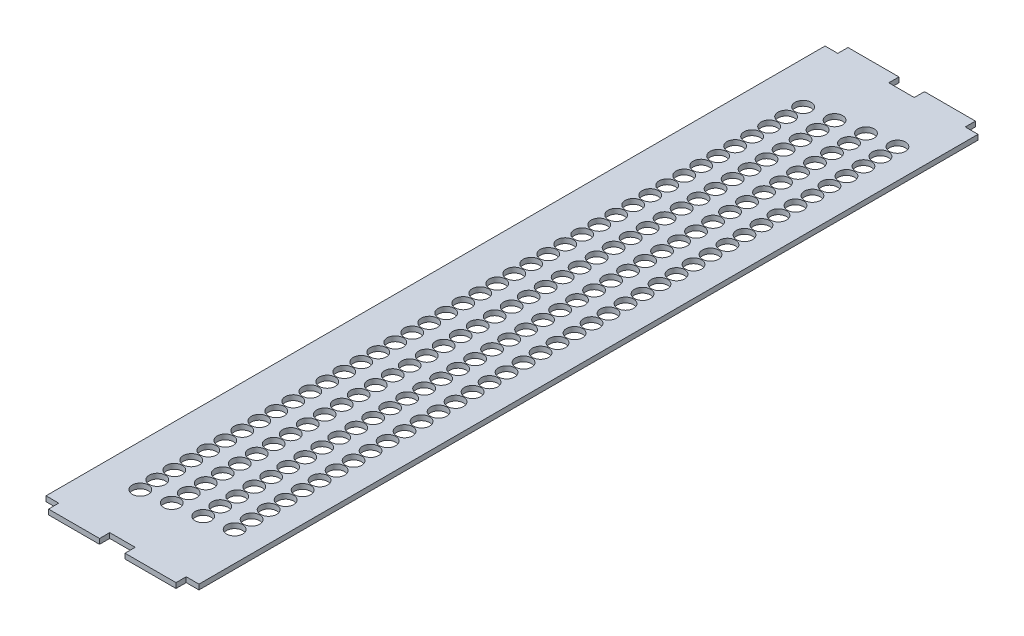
from build123d import *

# Parameters (mm, degrees)
CROQUIS1_R              = 4.75
SALIENTE_EXTRUIR1_DEPTH = 3


with BuildPart() as part:
    # Croquis1 → Saliente-Extruir1 (new body)
    with BuildSketch(Plane(origin=(0, 0, 0), x_dir=(1, 0, 0), z_dir=(0, 1, 0))):
        Polygon((0, 0), (7.5, 0), (7.5, -6), (37.5, -6), (37.5, 0), (52.5, 0), (52.5, -6), (82.5, -6), (82.5, 0), (90, 0), (90, 458.4), (82.5, 458.4), (82.5, 464.4), (52.5, 464.4), (52.5, 458.4), (37.5, 458.4), (37.5, 464.4), (7.5, 464.4), (7.5, 458.4), (0, 458.4), align=None)
        with Locations(Location((24.6, 420.9, 0), (0, 0, 270))):
            Circle(CROQUIS1_R, mode=Mode.SUBTRACT)
        with Locations(Location((40.6, 423.4, 0), (0, 0, 270))):
            Circle(CROQUIS1_R, mode=Mode.SUBTRACT)
        with Locations(Location((56.6, 425.9, 0), (0, 0, 270))):
            Circle(CROQUIS1_R, mode=Mode.SUBTRACT)
        with Locations(Location((72.6, 428.4, 0), (0, 0, 270))):
            Circle(CROQUIS1_R, mode=Mode.SUBTRACT)
        with Locations(Location((24.6, 410.9, 0), (0, 0, 270))):
            Circle(CROQUIS1_R, mode=Mode.SUBTRACT)
        with Locations(Location((40.6, 413.4, 0), (0, 0, 270))):
            Circle(CROQUIS1_R, mode=Mode.SUBTRACT)
        with Locations(Location((56.6, 415.9, 0), (0, 0, 270))):
            Circle(CROQUIS1_R, mode=Mode.SUBTRACT)
        with Locations(Location((72.6, 418.4, 0), (0, 0, 270))):
            Circle(CROQUIS1_R, mode=Mode.SUBTRACT)
        with Locations(Location((24.6, 400.9, 0), (0, 0, 270))):
            Circle(CROQUIS1_R, mode=Mode.SUBTRACT)
        with Locations(Location((40.6, 403.4, 0), (0, 0, 270))):
            Circle(CROQUIS1_R, mode=Mode.SUBTRACT)
        with Locations(Location((56.6, 405.9, 0), (0, 0, 270))):
            Circle(CROQUIS1_R, mode=Mode.SUBTRACT)
        with Locations(Location((72.6, 408.4, 0), (0, 0, 270))):
            Circle(CROQUIS1_R, mode=Mode.SUBTRACT)
        with Locations(Location((24.6, 390.9, 0), (0, 0, 270))):
            Circle(CROQUIS1_R, mode=Mode.SUBTRACT)
        with Locations(Location((40.6, 393.4, 0), (0, 0, 270))):
            Circle(CROQUIS1_R, mode=Mode.SUBTRACT)
        with Locations(Location((56.6, 395.9, 0), (0, 0, 270))):
            Circle(CROQUIS1_R, mode=Mode.SUBTRACT)
        with Locations(Location((72.6, 398.4, 0), (0, 0, 270))):
            Circle(CROQUIS1_R, mode=Mode.SUBTRACT)
        with Locations(Location((24.6, 380.9, 0), (0, 0, 270))):
            Circle(CROQUIS1_R, mode=Mode.SUBTRACT)
        with Locations(Location((40.6, 383.4, 0), (0, 0, 270))):
            Circle(CROQUIS1_R, mode=Mode.SUBTRACT)
        with Locations(Location((56.6, 385.9, 0), (0, 0, 270))):
            Circle(CROQUIS1_R, mode=Mode.SUBTRACT)
        with Locations(Location((72.6, 388.4, 0), (0, 0, 270))):
            Circle(CROQUIS1_R, mode=Mode.SUBTRACT)
        with Locations(Location((24.6, 370.9, 0), (0, 0, 270))):
            Circle(CROQUIS1_R, mode=Mode.SUBTRACT)
        with Locations(Location((40.6, 373.4, 0), (0, 0, 270))):
            Circle(CROQUIS1_R, mode=Mode.SUBTRACT)
        with Locations(Location((56.6, 375.9, 0), (0, 0, 270))):
            Circle(CROQUIS1_R, mode=Mode.SUBTRACT)
        with Locations(Location((72.6, 378.4, 0), (0, 0, 270))):
            Circle(CROQUIS1_R, mode=Mode.SUBTRACT)
        with Locations(Location((24.6, 360.9, 0), (0, 0, 270))):
            Circle(CROQUIS1_R, mode=Mode.SUBTRACT)
        with Locations(Location((40.6, 363.4, 0), (0, 0, 270))):
            Circle(CROQUIS1_R, mode=Mode.SUBTRACT)
        with Locations(Location((56.6, 365.9, 0), (0, 0, 270))):
            Circle(CROQUIS1_R, mode=Mode.SUBTRACT)
        with Locations(Location((72.6, 368.4, 0), (0, 0, 270))):
            Circle(CROQUIS1_R, mode=Mode.SUBTRACT)
        with Locations(Location((24.6, 350.9, 0), (0, 0, 270))):
            Circle(CROQUIS1_R, mode=Mode.SUBTRACT)
        with Locations(Location((40.6, 353.4, 0), (0, 0, 270))):
            Circle(CROQUIS1_R, mode=Mode.SUBTRACT)
        with Locations(Location((56.6, 355.9, 0), (0, 0, 270))):
            Circle(CROQUIS1_R, mode=Mode.SUBTRACT)
        with Locations(Location((72.6, 358.4, 0), (0, 0, 270))):
            Circle(CROQUIS1_R, mode=Mode.SUBTRACT)
        with Locations(Location((24.6, 340.9, 0), (0, 0, 270))):
            Circle(CROQUIS1_R, mode=Mode.SUBTRACT)
        with Locations(Location((40.6, 343.4, 0), (0, 0, 270))):
            Circle(CROQUIS1_R, mode=Mode.SUBTRACT)
        with Locations(Location((56.6, 345.9, 0), (0, 0, 270))):
            Circle(CROQUIS1_R, mode=Mode.SUBTRACT)
        with Locations(Location((72.6, 348.4, 0), (0, 0, 270))):
            Circle(CROQUIS1_R, mode=Mode.SUBTRACT)
        with Locations(Location((24.6, 330.9, 0), (0, 0, 270))):
            Circle(CROQUIS1_R, mode=Mode.SUBTRACT)
        with Locations(Location((40.6, 333.4, 0), (0, 0, 270))):
            Circle(CROQUIS1_R, mode=Mode.SUBTRACT)
        with Locations(Location((56.6, 335.9, 0), (0, 0, 270))):
            Circle(CROQUIS1_R, mode=Mode.SUBTRACT)
        with Locations(Location((72.6, 338.4, 0), (0, 0, 270))):
            Circle(CROQUIS1_R, mode=Mode.SUBTRACT)
        with Locations(Location((24.6, 320.9, 0), (0, 0, 270))):
            Circle(CROQUIS1_R, mode=Mode.SUBTRACT)
        with Locations(Location((40.6, 323.4, 0), (0, 0, 270))):
            Circle(CROQUIS1_R, mode=Mode.SUBTRACT)
        with Locations(Location((56.6, 325.9, 0), (0, 0, 270))):
            Circle(CROQUIS1_R, mode=Mode.SUBTRACT)
        with Locations(Location((72.6, 328.4, 0), (0, 0, 270))):
            Circle(CROQUIS1_R, mode=Mode.SUBTRACT)
        with Locations(Location((24.6, 310.9, 0), (0, 0, 270))):
            Circle(CROQUIS1_R, mode=Mode.SUBTRACT)
        with Locations(Location((40.6, 313.4, 0), (0, 0, 270))):
            Circle(CROQUIS1_R, mode=Mode.SUBTRACT)
        with Locations(Location((56.6, 315.9, 0), (0, 0, 270))):
            Circle(CROQUIS1_R, mode=Mode.SUBTRACT)
        with Locations(Location((72.6, 318.4, 0), (0, 0, 270))):
            Circle(CROQUIS1_R, mode=Mode.SUBTRACT)
        with Locations(Location((24.6, 300.9, 0), (0, 0, 270))):
            Circle(CROQUIS1_R, mode=Mode.SUBTRACT)
        with Locations(Location((40.6, 303.4, 0), (0, 0, 270))):
            Circle(CROQUIS1_R, mode=Mode.SUBTRACT)
        with Locations(Location((56.6, 305.9, 0), (0, 0, 270))):
            Circle(CROQUIS1_R, mode=Mode.SUBTRACT)
        with Locations(Location((72.6, 308.4, 0), (0, 0, 270))):
            Circle(CROQUIS1_R, mode=Mode.SUBTRACT)
        with Locations(Location((24.6, 290.9, 0), (0, 0, 270))):
            Circle(CROQUIS1_R, mode=Mode.SUBTRACT)
        with Locations(Location((40.6, 293.4, 0), (0, 0, 270))):
            Circle(CROQUIS1_R, mode=Mode.SUBTRACT)
        with Locations(Location((56.6, 295.9, 0), (0, 0, 270))):
            Circle(CROQUIS1_R, mode=Mode.SUBTRACT)
        with Locations(Location((72.6, 298.4, 0), (0, 0, 270))):
            Circle(CROQUIS1_R, mode=Mode.SUBTRACT)
        with Locations(Location((24.6, 280.9, 0), (0, 0, 270))):
            Circle(CROQUIS1_R, mode=Mode.SUBTRACT)
        with Locations(Location((40.6, 283.4, 0), (0, 0, 270))):
            Circle(CROQUIS1_R, mode=Mode.SUBTRACT)
        with Locations(Location((56.6, 285.9, 0), (0, 0, 270))):
            Circle(CROQUIS1_R, mode=Mode.SUBTRACT)
        with Locations(Location((72.6, 288.4, 0), (0, 0, 270))):
            Circle(CROQUIS1_R, mode=Mode.SUBTRACT)
        with Locations(Location((24.6, 270.9, 0), (0, 0, 270))):
            Circle(CROQUIS1_R, mode=Mode.SUBTRACT)
        with Locations(Location((40.6, 273.4, 0), (0, 0, 270))):
            Circle(CROQUIS1_R, mode=Mode.SUBTRACT)
        with Locations(Location((56.6, 275.9, 0), (0, 0, 270))):
            Circle(CROQUIS1_R, mode=Mode.SUBTRACT)
        with Locations(Location((72.6, 278.4, 0), (0, 0, 270))):
            Circle(CROQUIS1_R, mode=Mode.SUBTRACT)
        with Locations(Location((24.6, 260.9, 0), (0, 0, 270))):
            Circle(CROQUIS1_R, mode=Mode.SUBTRACT)
        with Locations(Location((40.6, 263.4, 0), (0, 0, 270))):
            Circle(CROQUIS1_R, mode=Mode.SUBTRACT)
        with Locations(Location((56.6, 265.9, 0), (0, 0, 270))):
            Circle(CROQUIS1_R, mode=Mode.SUBTRACT)
        with Locations(Location((72.6, 268.4, 0), (0, 0, 270))):
            Circle(CROQUIS1_R, mode=Mode.SUBTRACT)
        with Locations(Location((24.6, 250.9, 0), (0, 0, 270))):
            Circle(CROQUIS1_R, mode=Mode.SUBTRACT)
        with Locations(Location((40.6, 253.4, 0), (0, 0, 270))):
            Circle(CROQUIS1_R, mode=Mode.SUBTRACT)
        with Locations(Location((56.6, 255.9, 0), (0, 0, 270))):
            Circle(CROQUIS1_R, mode=Mode.SUBTRACT)
        with Locations(Location((72.6, 258.4, 0), (0, 0, 270))):
            Circle(CROQUIS1_R, mode=Mode.SUBTRACT)
        with Locations(Location((24.6, 240.9, 0), (0, 0, 270))):
            Circle(CROQUIS1_R, mode=Mode.SUBTRACT)
        with Locations(Location((40.6, 243.4, 0), (0, 0, 270))):
            Circle(CROQUIS1_R, mode=Mode.SUBTRACT)
        with Locations(Location((56.6, 245.9, 0), (0, 0, 270))):
            Circle(CROQUIS1_R, mode=Mode.SUBTRACT)
        with Locations(Location((72.6, 248.4, 0), (0, 0, 270))):
            Circle(CROQUIS1_R, mode=Mode.SUBTRACT)
        with Locations(Location((24.6, 230.9, 0), (0, 0, 270))):
            Circle(CROQUIS1_R, mode=Mode.SUBTRACT)
        with Locations(Location((40.6, 233.4, 0), (0, 0, 270))):
            Circle(CROQUIS1_R, mode=Mode.SUBTRACT)
        with Locations(Location((56.6, 235.9, 0), (0, 0, 270))):
            Circle(CROQUIS1_R, mode=Mode.SUBTRACT)
        with Locations(Location((72.6, 238.4, 0), (0, 0, 270))):
            Circle(CROQUIS1_R, mode=Mode.SUBTRACT)
        with Locations(Location((24.6, 220.9, 0), (0, 0, 270))):
            Circle(CROQUIS1_R, mode=Mode.SUBTRACT)
        with Locations(Location((40.6, 223.4, 0), (0, 0, 270))):
            Circle(CROQUIS1_R, mode=Mode.SUBTRACT)
        with Locations(Location((56.6, 225.9, 0), (0, 0, 270))):
            Circle(CROQUIS1_R, mode=Mode.SUBTRACT)
        with Locations(Location((72.6, 228.4, 0), (0, 0, 270))):
            Circle(CROQUIS1_R, mode=Mode.SUBTRACT)
        with Locations(Location((24.6, 210.9, 0), (0, 0, 270))):
            Circle(CROQUIS1_R, mode=Mode.SUBTRACT)
        with Locations(Location((40.6, 213.4, 0), (0, 0, 270))):
            Circle(CROQUIS1_R, mode=Mode.SUBTRACT)
        with Locations(Location((56.6, 215.9, 0), (0, 0, 270))):
            Circle(CROQUIS1_R, mode=Mode.SUBTRACT)
        with Locations(Location((72.6, 218.4, 0), (0, 0, 270))):
            Circle(CROQUIS1_R, mode=Mode.SUBTRACT)
        with Locations(Location((24.6, 200.9, 0), (0, 0, 270))):
            Circle(CROQUIS1_R, mode=Mode.SUBTRACT)
        with Locations(Location((40.6, 203.4, 0), (0, 0, 270))):
            Circle(CROQUIS1_R, mode=Mode.SUBTRACT)
        with Locations(Location((56.6, 205.9, 0), (0, 0, 270))):
            Circle(CROQUIS1_R, mode=Mode.SUBTRACT)
        with Locations(Location((72.6, 208.4, 0), (0, 0, 270))):
            Circle(CROQUIS1_R, mode=Mode.SUBTRACT)
        with Locations(Location((24.6, 190.9, 0), (0, 0, 270))):
            Circle(CROQUIS1_R, mode=Mode.SUBTRACT)
        with Locations(Location((40.6, 193.4, 0), (0, 0, 270))):
            Circle(CROQUIS1_R, mode=Mode.SUBTRACT)
        with Locations(Location((56.6, 195.9, 0), (0, 0, 270))):
            Circle(CROQUIS1_R, mode=Mode.SUBTRACT)
        with Locations(Location((72.6, 198.4, 0), (0, 0, 270))):
            Circle(CROQUIS1_R, mode=Mode.SUBTRACT)
        with Locations(Location((24.6, 180.9, 0), (0, 0, 270))):
            Circle(CROQUIS1_R, mode=Mode.SUBTRACT)
        with Locations(Location((40.6, 183.4, 0), (0, 0, 270))):
            Circle(CROQUIS1_R, mode=Mode.SUBTRACT)
        with Locations(Location((56.6, 185.9, 0), (0, 0, 270))):
            Circle(CROQUIS1_R, mode=Mode.SUBTRACT)
        with Locations(Location((72.6, 188.4, 0), (0, 0, 270))):
            Circle(CROQUIS1_R, mode=Mode.SUBTRACT)
        with Locations(Location((24.6, 170.9, 0), (0, 0, 270))):
            Circle(CROQUIS1_R, mode=Mode.SUBTRACT)
        with Locations(Location((40.6, 173.4, 0), (0, 0, 270))):
            Circle(CROQUIS1_R, mode=Mode.SUBTRACT)
        with Locations(Location((56.6, 175.9, 0), (0, 0, 270))):
            Circle(CROQUIS1_R, mode=Mode.SUBTRACT)
        with Locations(Location((72.6, 178.4, 0), (0, 0, 270))):
            Circle(CROQUIS1_R, mode=Mode.SUBTRACT)
        with Locations(Location((24.6, 160.9, 0), (0, 0, 270))):
            Circle(CROQUIS1_R, mode=Mode.SUBTRACT)
        with Locations(Location((40.6, 163.4, 0), (0, 0, 270))):
            Circle(CROQUIS1_R, mode=Mode.SUBTRACT)
        with Locations(Location((56.6, 165.9, 0), (0, 0, 270))):
            Circle(CROQUIS1_R, mode=Mode.SUBTRACT)
        with Locations(Location((72.6, 168.4, 0), (0, 0, 270))):
            Circle(CROQUIS1_R, mode=Mode.SUBTRACT)
        with Locations(Location((24.6, 150.9, 0), (0, 0, 270))):
            Circle(CROQUIS1_R, mode=Mode.SUBTRACT)
        with Locations(Location((40.6, 153.4, 0), (0, 0, 270))):
            Circle(CROQUIS1_R, mode=Mode.SUBTRACT)
        with Locations(Location((56.6, 155.9, 0), (0, 0, 270))):
            Circle(CROQUIS1_R, mode=Mode.SUBTRACT)
        with Locations(Location((72.6, 158.4, 0), (0, 0, 270))):
            Circle(CROQUIS1_R, mode=Mode.SUBTRACT)
        with Locations(Location((24.6, 140.9, 0), (0, 0, 270))):
            Circle(CROQUIS1_R, mode=Mode.SUBTRACT)
        with Locations(Location((40.6, 143.4, 0), (0, 0, 270))):
            Circle(CROQUIS1_R, mode=Mode.SUBTRACT)
        with Locations(Location((56.6, 145.9, 0), (0, 0, 270))):
            Circle(CROQUIS1_R, mode=Mode.SUBTRACT)
        with Locations(Location((72.6, 148.4, 0), (0, 0, 270))):
            Circle(CROQUIS1_R, mode=Mode.SUBTRACT)
        with Locations(Location((24.6, 130.9, 0), (0, 0, 270))):
            Circle(CROQUIS1_R, mode=Mode.SUBTRACT)
        with Locations(Location((40.6, 133.4, 0), (0, 0, 270))):
            Circle(CROQUIS1_R, mode=Mode.SUBTRACT)
        with Locations(Location((56.6, 135.9, 0), (0, 0, 270))):
            Circle(CROQUIS1_R, mode=Mode.SUBTRACT)
        with Locations(Location((72.6, 138.4, 0), (0, 0, 270))):
            Circle(CROQUIS1_R, mode=Mode.SUBTRACT)
        with Locations(Location((24.6, 120.9, 0), (0, 0, 270))):
            Circle(CROQUIS1_R, mode=Mode.SUBTRACT)
        with Locations(Location((40.6, 123.4, 0), (0, 0, 270))):
            Circle(CROQUIS1_R, mode=Mode.SUBTRACT)
        with Locations(Location((56.6, 125.9, 0), (0, 0, 270))):
            Circle(CROQUIS1_R, mode=Mode.SUBTRACT)
        with Locations(Location((72.6, 128.4, 0), (0, 0, 270))):
            Circle(CROQUIS1_R, mode=Mode.SUBTRACT)
        with Locations(Location((24.6, 110.9, 0), (0, 0, 270))):
            Circle(CROQUIS1_R, mode=Mode.SUBTRACT)
        with Locations(Location((40.6, 113.4, 0), (0, 0, 270))):
            Circle(CROQUIS1_R, mode=Mode.SUBTRACT)
        with Locations(Location((56.6, 115.9, 0), (0, 0, 270))):
            Circle(CROQUIS1_R, mode=Mode.SUBTRACT)
        with Locations(Location((72.6, 118.4, 0), (0, 0, 270))):
            Circle(CROQUIS1_R, mode=Mode.SUBTRACT)
        with Locations(Location((24.6, 100.9, 0), (0, 0, 270))):
            Circle(CROQUIS1_R, mode=Mode.SUBTRACT)
        with Locations(Location((40.6, 103.4, 0), (0, 0, 270))):
            Circle(CROQUIS1_R, mode=Mode.SUBTRACT)
        with Locations(Location((56.6, 105.9, 0), (0, 0, 270))):
            Circle(CROQUIS1_R, mode=Mode.SUBTRACT)
        with Locations(Location((72.6, 108.4, 0), (0, 0, 270))):
            Circle(CROQUIS1_R, mode=Mode.SUBTRACT)
        with Locations(Location((24.6, 90.9, 0), (0, 0, 270))):
            Circle(CROQUIS1_R, mode=Mode.SUBTRACT)
        with Locations(Location((40.6, 93.4, 0), (0, 0, 270))):
            Circle(CROQUIS1_R, mode=Mode.SUBTRACT)
        with Locations(Location((56.6, 95.9, 0), (0, 0, 270))):
            Circle(CROQUIS1_R, mode=Mode.SUBTRACT)
        with Locations(Location((72.6, 98.4, 0), (0, 0, 270))):
            Circle(CROQUIS1_R, mode=Mode.SUBTRACT)
        with Locations(Location((24.6, 80.9, 0), (0, 0, 270))):
            Circle(CROQUIS1_R, mode=Mode.SUBTRACT)
        with Locations(Location((40.6, 83.4, 0), (0, 0, 270))):
            Circle(CROQUIS1_R, mode=Mode.SUBTRACT)
        with Locations(Location((56.6, 85.9, 0), (0, 0, 270))):
            Circle(CROQUIS1_R, mode=Mode.SUBTRACT)
        with Locations(Location((72.6, 88.4, 0), (0, 0, 270))):
            Circle(CROQUIS1_R, mode=Mode.SUBTRACT)
        with Locations(Location((24.6, 70.9, 0), (0, 0, 270))):
            Circle(CROQUIS1_R, mode=Mode.SUBTRACT)
        with Locations(Location((40.6, 73.4, 0), (0, 0, 270))):
            Circle(CROQUIS1_R, mode=Mode.SUBTRACT)
        with Locations(Location((56.6, 75.9, 0), (0, 0, 270))):
            Circle(CROQUIS1_R, mode=Mode.SUBTRACT)
        with Locations(Location((72.6, 78.4, 0), (0, 0, 270))):
            Circle(CROQUIS1_R, mode=Mode.SUBTRACT)
        with Locations(Location((24.6, 60.9, 0), (0, 0, 270))):
            Circle(CROQUIS1_R, mode=Mode.SUBTRACT)
        with Locations(Location((40.6, 63.4, 0), (0, 0, 270))):
            Circle(CROQUIS1_R, mode=Mode.SUBTRACT)
        with Locations(Location((56.6, 65.9, 0), (0, 0, 270))):
            Circle(CROQUIS1_R, mode=Mode.SUBTRACT)
        with Locations(Location((72.6, 68.4, 0), (0, 0, 270))):
            Circle(CROQUIS1_R, mode=Mode.SUBTRACT)
        with Locations(Location((24.6, 50.9, 0), (0, 0, 270))):
            Circle(CROQUIS1_R, mode=Mode.SUBTRACT)
        with Locations(Location((40.6, 53.4, 0), (0, 0, 270))):
            Circle(CROQUIS1_R, mode=Mode.SUBTRACT)
        with Locations(Location((56.6, 55.9, 0), (0, 0, 270))):
            Circle(CROQUIS1_R, mode=Mode.SUBTRACT)
        with Locations(Location((72.6, 58.4, 0), (0, 0, 270))):
            Circle(CROQUIS1_R, mode=Mode.SUBTRACT)
        with Locations(Location((24.6, 40.9, 0), (0, 0, 270))):
            Circle(CROQUIS1_R, mode=Mode.SUBTRACT)
        with Locations(Location((40.6, 43.4, 0), (0, 0, 270))):
            Circle(CROQUIS1_R, mode=Mode.SUBTRACT)
        with Locations(Location((56.6, 45.9, 0), (0, 0, 270))):
            Circle(CROQUIS1_R, mode=Mode.SUBTRACT)
        with Locations(Location((72.6, 48.4, 0), (0, 0, 270))):
            Circle(CROQUIS1_R, mode=Mode.SUBTRACT)
        with Locations(Location((24.6, 30.9, 0), (0, 0, 270))):
            Circle(CROQUIS1_R, mode=Mode.SUBTRACT)
        with Locations(Location((40.6, 33.4, 0), (0, 0, 270))):
            Circle(CROQUIS1_R, mode=Mode.SUBTRACT)
        with Locations(Location((56.6, 35.9, 0), (0, 0, 270))):
            Circle(CROQUIS1_R, mode=Mode.SUBTRACT)
        with Locations(Location((72.6, 38.4, 0), (0, 0, 270))):
            Circle(CROQUIS1_R, mode=Mode.SUBTRACT)
    extrude(amount=SALIENTE_EXTRUIR1_DEPTH)


solid = part.part
